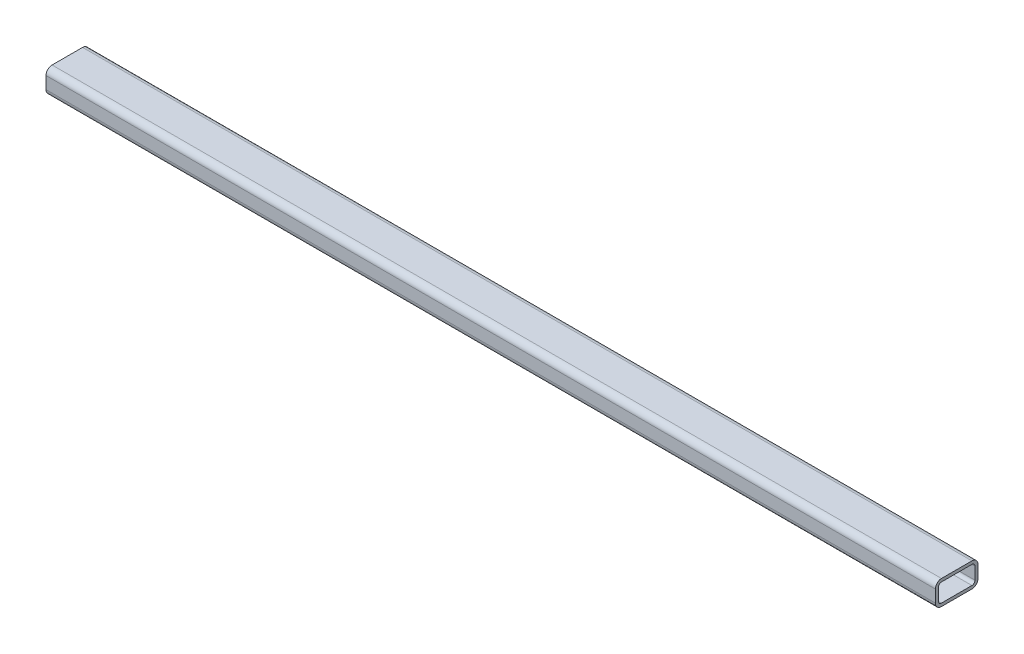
ISO-10303-21;
HEADER;
FILE_DESCRIPTION(('STEP AP214'),'2;1');
FILE_NAME('part.step','',(''),(''),'','','');
FILE_SCHEMA(('AUTOMOTIVE_DESIGN { 1 0 10303 214 1 1 1 1 }'));
ENDSEC;
DATA;
#1=APPLICATION_CONTEXT('core data for automotive mechanical design processes');
#2=APPLICATION_PROTOCOL_DEFINITION('international standard','automotive_design',2000,#1);
#3=PRODUCT_CONTEXT('',#1,'mechanical');
#4=PRODUCT('Part','Part','',(#3));
#5=PRODUCT_RELATED_PRODUCT_CATEGORY('part','',(#4));
#6=PRODUCT_DEFINITION_FORMATION('','',#4);
#7=PRODUCT_DEFINITION_CONTEXT('part definition',#1,'design');
#8=PRODUCT_DEFINITION('design','',#6,#7);
#9=PRODUCT_DEFINITION_SHAPE('','',#8);
#10=(LENGTH_UNIT() NAMED_UNIT(*) SI_UNIT(.MILLI.,.METRE.));
#11=(NAMED_UNIT(*) PLANE_ANGLE_UNIT() SI_UNIT($,.RADIAN.));
#12=(NAMED_UNIT(*) SI_UNIT($,.STERADIAN.) SOLID_ANGLE_UNIT());
#13=UNCERTAINTY_MEASURE_WITH_UNIT(LENGTH_MEASURE(1.E-05),#10,'distance_accuracy_value','');
#14=(GEOMETRIC_REPRESENTATION_CONTEXT(3) GLOBAL_UNCERTAINTY_ASSIGNED_CONTEXT((#13)) GLOBAL_UNIT_ASSIGNED_CONTEXT((#10,
#11,#12)) REPRESENTATION_CONTEXT('',''));
#15=CARTESIAN_POINT('',(0.,0.,0.));
#16=DIRECTION('',(0.,0.,1.));
#17=DIRECTION('',(1.,0.,0.));
#18=AXIS2_PLACEMENT_3D('',#15,#16,#17);
#19=CARTESIAN_POINT('',(730.,5.,-12.5));
#20=DIRECTION('',(1.,0.,0.));
#21=DIRECTION('',(0.,0.,-1.));
#22=AXIS2_PLACEMENT_3D('',#19,#20,#21);
#23=PLANE('',#22);
#24=CARTESIAN_POINT('',(730.,5.,-12.5));
#25=DIRECTION('',(1.,0.,0.));
#26=DIRECTION('',(0.,0.,-1.));
#27=AXIS2_PLACEMENT_3D('',#24,#25,#26);
#28=CIRCLE('',#27,5.);
#29=CARTESIAN_POINT('',(730.,5.,-17.5));
#30=VERTEX_POINT('',#29);
#31=CARTESIAN_POINT('',(730.,10.,-12.5));
#32=VERTEX_POINT('',#31);
#33=EDGE_CURVE('E228',#30,#32,#28,.T.);
#34=ORIENTED_EDGE('',*,*,#33,.T.);
#35=DIRECTION('',(0.,0.,1.));
#36=VECTOR('',#35,1.);
#37=CARTESIAN_POINT('',(730.,10.,12.5));
#38=LINE('',#37,#36);
#39=CARTESIAN_POINT('',(730.,10.,12.5));
#40=VERTEX_POINT('',#39);
#41=EDGE_CURVE('E231',#32,#40,#38,.T.);
#42=ORIENTED_EDGE('',*,*,#41,.T.);
#43=CARTESIAN_POINT('',(730.,5.,12.5));
#44=DIRECTION('',(1.,0.,0.));
#45=DIRECTION('',(0.,0.,1.));
#46=AXIS2_PLACEMENT_3D('',#43,#44,#45);
#47=CIRCLE('',#46,5.);
#48=CARTESIAN_POINT('',(730.,5.,17.5));
#49=VERTEX_POINT('',#48);
#50=EDGE_CURVE('E233',#40,#49,#47,.T.);
#51=ORIENTED_EDGE('',*,*,#50,.T.);
#52=DIRECTION('',(0.,-1.,0.));
#53=VECTOR('',#52,1.);
#54=CARTESIAN_POINT('',(730.,5.,17.5));
#55=LINE('',#54,#53);
#56=CARTESIAN_POINT('',(730.,-5.,17.5));
#57=VERTEX_POINT('',#56);
#58=EDGE_CURVE('E235',#49,#57,#55,.T.);
#59=ORIENTED_EDGE('',*,*,#58,.T.);
#60=CARTESIAN_POINT('',(730.,-5.,12.5));
#61=DIRECTION('',(1.,0.,0.));
#62=DIRECTION('',(0.,0.,1.));
#63=AXIS2_PLACEMENT_3D('',#60,#61,#62);
#64=CIRCLE('',#63,5.);
#65=CARTESIAN_POINT('',(730.,-10.,12.5));
#66=VERTEX_POINT('',#65);
#67=EDGE_CURVE('E237',#57,#66,#64,.T.);
#68=ORIENTED_EDGE('',*,*,#67,.T.);
#69=DIRECTION('',(0.,0.,-1.));
#70=VECTOR('',#69,1.);
#71=CARTESIAN_POINT('',(730.,-10.,12.5));
#72=LINE('',#71,#70);
#73=CARTESIAN_POINT('',(730.,-10.,-12.5));
#74=VERTEX_POINT('',#73);
#75=EDGE_CURVE('E239',#66,#74,#72,.T.);
#76=ORIENTED_EDGE('',*,*,#75,.T.);
#77=CARTESIAN_POINT('',(730.,-5.,-12.5));
#78=DIRECTION('',(1.,0.,0.));
#79=DIRECTION('',(0.,0.,1.));
#80=AXIS2_PLACEMENT_3D('',#77,#78,#79);
#81=CIRCLE('',#80,5.);
#82=CARTESIAN_POINT('',(730.,-5.,-17.5));
#83=VERTEX_POINT('',#82);
#84=EDGE_CURVE('E241',#74,#83,#81,.T.);
#85=ORIENTED_EDGE('',*,*,#84,.T.);
#86=DIRECTION('',(0.,1.,0.));
#87=VECTOR('',#86,1.);
#88=CARTESIAN_POINT('',(730.,5.,-17.5));
#89=LINE('',#88,#87);
#90=EDGE_CURVE('E243',#83,#30,#89,.T.);
#91=ORIENTED_EDGE('',*,*,#90,.T.);
#92=EDGE_LOOP('',(#34,#42,#51,#59,#68,#76,#85,#91));
#93=FACE_BOUND('',#92,.T.);
#94=DIRECTION('',(0.,-1.,0.));
#95=VECTOR('',#94,1.);
#96=CARTESIAN_POINT('',(730.,5.,15.));
#97=LINE('',#96,#95);
#98=CARTESIAN_POINT('',(730.,5.,15.));
#99=VERTEX_POINT('',#98);
#100=CARTESIAN_POINT('',(730.,-5.,15.));
#101=VERTEX_POINT('',#100);
#102=EDGE_CURVE('E186',#99,#101,#97,.T.);
#103=ORIENTED_EDGE('',*,*,#102,.F.);
#104=CARTESIAN_POINT('',(730.,5.,12.5));
#105=DIRECTION('',(1.,0.,0.));
#106=DIRECTION('',(0.,0.,1.));
#107=AXIS2_PLACEMENT_3D('',#104,#105,#106);
#108=CIRCLE('',#107,2.5);
#109=CARTESIAN_POINT('',(730.,7.5,12.5));
#110=VERTEX_POINT('',#109);
#111=EDGE_CURVE('E163',#110,#99,#108,.T.);
#112=ORIENTED_EDGE('',*,*,#111,.F.);
#113=DIRECTION('',(0.,0.,1.));
#114=VECTOR('',#113,1.);
#115=CARTESIAN_POINT('',(730.,7.5,12.5));
#116=LINE('',#115,#114);
#117=CARTESIAN_POINT('',(730.,7.5,-12.5));
#118=VERTEX_POINT('',#117);
#119=EDGE_CURVE('E198',#118,#110,#116,.T.);
#120=ORIENTED_EDGE('',*,*,#119,.F.);
#121=CARTESIAN_POINT('',(730.,5.,-12.5));
#122=DIRECTION('',(1.,0.,0.));
#123=DIRECTION('',(0.,0.,-1.));
#124=AXIS2_PLACEMENT_3D('',#121,#122,#123);
#125=CIRCLE('',#124,2.5);
#126=CARTESIAN_POINT('',(730.,5.,-15.));
#127=VERTEX_POINT('',#126);
#128=EDGE_CURVE('E196',#127,#118,#125,.T.);
#129=ORIENTED_EDGE('',*,*,#128,.F.);
#130=DIRECTION('',(0.,1.,0.));
#131=VECTOR('',#130,1.);
#132=CARTESIAN_POINT('',(730.,5.,-15.));
#133=LINE('',#132,#131);
#134=CARTESIAN_POINT('',(730.,-5.,-15.));
#135=VERTEX_POINT('',#134);
#136=EDGE_CURVE('E194',#135,#127,#133,.T.);
#137=ORIENTED_EDGE('',*,*,#136,.F.);
#138=CARTESIAN_POINT('',(730.,-5.,-12.5));
#139=DIRECTION('',(1.,0.,0.));
#140=DIRECTION('',(0.,0.,1.));
#141=AXIS2_PLACEMENT_3D('',#138,#139,#140);
#142=CIRCLE('',#141,2.5);
#143=CARTESIAN_POINT('',(730.,-7.5,-12.5));
#144=VERTEX_POINT('',#143);
#145=EDGE_CURVE('E192',#144,#135,#142,.T.);
#146=ORIENTED_EDGE('',*,*,#145,.F.);
#147=DIRECTION('',(0.,0.,-1.));
#148=VECTOR('',#147,1.);
#149=CARTESIAN_POINT('',(730.,-7.5,12.5));
#150=LINE('',#149,#148);
#151=CARTESIAN_POINT('',(730.,-7.5,12.5));
#152=VERTEX_POINT('',#151);
#153=EDGE_CURVE('E190',#152,#144,#150,.T.);
#154=ORIENTED_EDGE('',*,*,#153,.F.);
#155=CARTESIAN_POINT('',(730.,-5.,12.5));
#156=DIRECTION('',(1.,0.,0.));
#157=DIRECTION('',(0.,0.,1.));
#158=AXIS2_PLACEMENT_3D('',#155,#156,#157);
#159=CIRCLE('',#158,2.5);
#160=EDGE_CURVE('E188',#101,#152,#159,.T.);
#161=ORIENTED_EDGE('',*,*,#160,.F.);
#162=EDGE_LOOP('',(#103,#112,#120,#129,#137,#146,#154,#161));
#163=FACE_BOUND('',#162,.T.);
#164=ADVANCED_FACE('F35',(#93,#163),#23,.T.);
#165=CARTESIAN_POINT('',(0.,5.,-12.5));
#166=DIRECTION('',(1.,0.,0.));
#167=DIRECTION('',(0.,0.,-1.));
#168=AXIS2_PLACEMENT_3D('',#165,#166,#167);
#169=PLANE('',#168);
#170=CARTESIAN_POINT('',(0.,5.,-12.5));
#171=DIRECTION('',(1.,0.,0.));
#172=DIRECTION('',(0.,0.,-1.));
#173=AXIS2_PLACEMENT_3D('',#170,#171,#172);
#174=CIRCLE('',#173,5.);
#175=CARTESIAN_POINT('',(0.,5.,-17.5));
#176=VERTEX_POINT('',#175);
#177=CARTESIAN_POINT('',(0.,10.,-12.5));
#178=VERTEX_POINT('',#177);
#179=EDGE_CURVE('E164',#176,#178,#174,.T.);
#180=ORIENTED_EDGE('',*,*,#179,.F.);
#181=DIRECTION('',(0.,1.,0.));
#182=VECTOR('',#181,1.);
#183=CARTESIAN_POINT('',(0.,5.,-17.5));
#184=LINE('',#183,#182);
#185=CARTESIAN_POINT('',(0.,-5.,-17.5));
#186=VERTEX_POINT('',#185);
#187=EDGE_CURVE('E226',#186,#176,#184,.T.);
#188=ORIENTED_EDGE('',*,*,#187,.F.);
#189=CARTESIAN_POINT('',(0.,-5.,-12.5));
#190=DIRECTION('',(1.,0.,0.));
#191=DIRECTION('',(0.,0.,1.));
#192=AXIS2_PLACEMENT_3D('',#189,#190,#191);
#193=CIRCLE('',#192,5.);
#194=CARTESIAN_POINT('',(0.,-10.,-12.5));
#195=VERTEX_POINT('',#194);
#196=EDGE_CURVE('E224',#195,#186,#193,.T.);
#197=ORIENTED_EDGE('',*,*,#196,.F.);
#198=DIRECTION('',(0.,0.,-1.));
#199=VECTOR('',#198,1.);
#200=CARTESIAN_POINT('',(0.,-10.,12.5));
#201=LINE('',#200,#199);
#202=CARTESIAN_POINT('',(0.,-10.,12.5));
#203=VERTEX_POINT('',#202);
#204=EDGE_CURVE('E222',#203,#195,#201,.T.);
#205=ORIENTED_EDGE('',*,*,#204,.F.);
#206=CARTESIAN_POINT('',(0.,-5.,12.5));
#207=DIRECTION('',(1.,0.,0.));
#208=DIRECTION('',(0.,0.,1.));
#209=AXIS2_PLACEMENT_3D('',#206,#207,#208);
#210=CIRCLE('',#209,5.);
#211=CARTESIAN_POINT('',(0.,-5.,17.5));
#212=VERTEX_POINT('',#211);
#213=EDGE_CURVE('E220',#212,#203,#210,.T.);
#214=ORIENTED_EDGE('',*,*,#213,.F.);
#215=DIRECTION('',(0.,-1.,0.));
#216=VECTOR('',#215,1.);
#217=CARTESIAN_POINT('',(0.,5.,17.5));
#218=LINE('',#217,#216);
#219=CARTESIAN_POINT('',(0.,5.,17.5));
#220=VERTEX_POINT('',#219);
#221=EDGE_CURVE('E218',#220,#212,#218,.T.);
#222=ORIENTED_EDGE('',*,*,#221,.F.);
#223=CARTESIAN_POINT('',(0.,5.,12.5));
#224=DIRECTION('',(1.,0.,0.));
#225=DIRECTION('',(0.,0.,1.));
#226=AXIS2_PLACEMENT_3D('',#223,#224,#225);
#227=CIRCLE('',#226,5.);
#228=CARTESIAN_POINT('',(0.,10.,12.5));
#229=VERTEX_POINT('',#228);
#230=EDGE_CURVE('E216',#229,#220,#227,.T.);
#231=ORIENTED_EDGE('',*,*,#230,.F.);
#232=DIRECTION('',(0.,0.,1.));
#233=VECTOR('',#232,1.);
#234=CARTESIAN_POINT('',(0.,10.,12.5));
#235=LINE('',#234,#233);
#236=EDGE_CURVE('E214',#178,#229,#235,.T.);
#237=ORIENTED_EDGE('',*,*,#236,.F.);
#238=EDGE_LOOP('',(#180,#188,#197,#205,#214,#222,#231,#237));
#239=FACE_BOUND('',#238,.T.);
#240=CARTESIAN_POINT('',(0.,5.,12.5));
#241=DIRECTION('',(1.,0.,0.));
#242=DIRECTION('',(0.,0.,1.));
#243=AXIS2_PLACEMENT_3D('',#240,#241,#242);
#244=CIRCLE('',#243,2.5);
#245=CARTESIAN_POINT('',(0.,7.5,12.5));
#246=VERTEX_POINT('',#245);
#247=CARTESIAN_POINT('',(0.,5.,15.));
#248=VERTEX_POINT('',#247);
#249=EDGE_CURVE('E58',#246,#248,#244,.T.);
#250=ORIENTED_EDGE('',*,*,#249,.T.);
#251=DIRECTION('',(0.,-1.,0.));
#252=VECTOR('',#251,1.);
#253=CARTESIAN_POINT('',(0.,5.,15.));
#254=LINE('',#253,#252);
#255=CARTESIAN_POINT('',(0.,-5.,15.));
#256=VERTEX_POINT('',#255);
#257=EDGE_CURVE('E150',#248,#256,#254,.T.);
#258=ORIENTED_EDGE('',*,*,#257,.T.);
#259=CARTESIAN_POINT('',(0.,-5.,12.5));
#260=DIRECTION('',(1.,0.,0.));
#261=DIRECTION('',(0.,0.,1.));
#262=AXIS2_PLACEMENT_3D('',#259,#260,#261);
#263=CIRCLE('',#262,2.5);
#264=CARTESIAN_POINT('',(0.,-7.5,12.5));
#265=VERTEX_POINT('',#264);
#266=EDGE_CURVE('E159',#256,#265,#263,.T.);
#267=ORIENTED_EDGE('',*,*,#266,.T.);
#268=DIRECTION('',(0.,0.,-1.));
#269=VECTOR('',#268,1.);
#270=CARTESIAN_POINT('',(0.,-7.5,12.5));
#271=LINE('',#270,#269);
#272=CARTESIAN_POINT('',(0.,-7.5,-12.5));
#273=VERTEX_POINT('',#272);
#274=EDGE_CURVE('E173',#265,#273,#271,.T.);
#275=ORIENTED_EDGE('',*,*,#274,.T.);
#276=CARTESIAN_POINT('',(0.,-5.,-12.5));
#277=DIRECTION('',(1.,0.,0.));
#278=DIRECTION('',(0.,0.,1.));
#279=AXIS2_PLACEMENT_3D('',#276,#277,#278);
#280=CIRCLE('',#279,2.5);
#281=CARTESIAN_POINT('',(0.,-5.,-15.));
#282=VERTEX_POINT('',#281);
#283=EDGE_CURVE('E176',#273,#282,#280,.T.);
#284=ORIENTED_EDGE('',*,*,#283,.T.);
#285=DIRECTION('',(0.,1.,0.));
#286=VECTOR('',#285,1.);
#287=CARTESIAN_POINT('',(0.,5.,-15.));
#288=LINE('',#287,#286);
#289=CARTESIAN_POINT('',(0.,5.,-15.));
#290=VERTEX_POINT('',#289);
#291=EDGE_CURVE('E179',#282,#290,#288,.T.);
#292=ORIENTED_EDGE('',*,*,#291,.T.);
#293=CARTESIAN_POINT('',(0.,5.,-12.5));
#294=DIRECTION('',(1.,0.,0.));
#295=DIRECTION('',(0.,0.,-1.));
#296=AXIS2_PLACEMENT_3D('',#293,#294,#295);
#297=CIRCLE('',#296,2.5);
#298=CARTESIAN_POINT('',(0.,7.5,-12.5));
#299=VERTEX_POINT('',#298);
#300=EDGE_CURVE('E182',#290,#299,#297,.T.);
#301=ORIENTED_EDGE('',*,*,#300,.T.);
#302=DIRECTION('',(0.,0.,1.));
#303=VECTOR('',#302,1.);
#304=CARTESIAN_POINT('',(0.,7.5,12.5));
#305=LINE('',#304,#303);
#306=EDGE_CURVE('E169',#299,#246,#305,.T.);
#307=ORIENTED_EDGE('',*,*,#306,.T.);
#308=EDGE_LOOP('',(#250,#258,#267,#275,#284,#292,#301,#307));
#309=FACE_BOUND('',#308,.T.);
#310=ADVANCED_FACE('F167',(#239,#309),#169,.F.);
#311=CARTESIAN_POINT('',(730.,5.,-12.5));
#312=DIRECTION('',(-1.,0.,0.));
#313=DIRECTION('',(0.,0.,1.));
#314=AXIS2_PLACEMENT_3D('',#311,#312,#313);
#315=CYLINDRICAL_SURFACE('',#314,5.);
#316=ORIENTED_EDGE('',*,*,#179,.T.);
#317=DIRECTION('',(-1.,0.,0.));
#318=VECTOR('',#317,1.);
#319=CARTESIAN_POINT('',(730.,10.,-12.5));
#320=LINE('',#319,#318);
#321=EDGE_CURVE('E11',#32,#178,#320,.T.);
#322=ORIENTED_EDGE('',*,*,#321,.F.);
#323=ORIENTED_EDGE('',*,*,#33,.F.);
#324=DIRECTION('',(-1.,0.,0.));
#325=VECTOR('',#324,1.);
#326=CARTESIAN_POINT('',(730.,5.,-17.5));
#327=LINE('',#326,#325);
#328=EDGE_CURVE('E245',#30,#176,#327,.T.);
#329=ORIENTED_EDGE('',*,*,#328,.T.);
#330=EDGE_LOOP('',(#316,#322,#323,#329));
#331=FACE_BOUND('',#330,.T.);
#332=ADVANCED_FACE('F37',(#331),#315,.T.);
#333=CARTESIAN_POINT('',(730.,10.,12.5));
#334=DIRECTION('',(0.,-1.,0.));
#335=DIRECTION('',(0.,0.,-1.));
#336=AXIS2_PLACEMENT_3D('',#333,#334,#335);
#337=PLANE('',#336);
#338=ORIENTED_EDGE('',*,*,#236,.T.);
#339=DIRECTION('',(-1.,0.,0.));
#340=VECTOR('',#339,1.);
#341=CARTESIAN_POINT('',(730.,10.,12.5));
#342=LINE('',#341,#340);
#343=EDGE_CURVE('E43',#40,#229,#342,.T.);
#344=ORIENTED_EDGE('',*,*,#343,.F.);
#345=ORIENTED_EDGE('',*,*,#41,.F.);
#346=ORIENTED_EDGE('',*,*,#321,.T.);
#347=EDGE_LOOP('',(#338,#344,#345,#346));
#348=FACE_BOUND('',#347,.T.);
#349=ADVANCED_FACE('F290',(#348),#337,.F.);
#350=CARTESIAN_POINT('',(730.,5.,12.5));
#351=DIRECTION('',(-1.,0.,0.));
#352=DIRECTION('',(0.,0.,1.));
#353=AXIS2_PLACEMENT_3D('',#350,#351,#352);
#354=CYLINDRICAL_SURFACE('',#353,5.);
#355=ORIENTED_EDGE('',*,*,#230,.T.);
#356=DIRECTION('',(-1.,0.,0.));
#357=VECTOR('',#356,1.);
#358=CARTESIAN_POINT('',(730.,5.,17.5));
#359=LINE('',#358,#357);
#360=EDGE_CURVE('E261',#49,#220,#359,.T.);
#361=ORIENTED_EDGE('',*,*,#360,.F.);
#362=ORIENTED_EDGE('',*,*,#50,.F.);
#363=ORIENTED_EDGE('',*,*,#343,.T.);
#364=EDGE_LOOP('',(#355,#361,#362,#363));
#365=FACE_BOUND('',#364,.T.);
#366=ADVANCED_FACE('F268',(#365),#354,.T.);
#367=CARTESIAN_POINT('',(730.,5.,17.5));
#368=DIRECTION('',(0.,0.,-1.));
#369=DIRECTION('',(-1.,0.,0.));
#370=AXIS2_PLACEMENT_3D('',#367,#368,#369);
#371=PLANE('',#370);
#372=ORIENTED_EDGE('',*,*,#221,.T.);
#373=DIRECTION('',(-1.,0.,0.));
#374=VECTOR('',#373,1.);
#375=CARTESIAN_POINT('',(730.,-5.,17.5));
#376=LINE('',#375,#374);
#377=EDGE_CURVE('E258',#57,#212,#376,.T.);
#378=ORIENTED_EDGE('',*,*,#377,.F.);
#379=ORIENTED_EDGE('',*,*,#58,.F.);
#380=ORIENTED_EDGE('',*,*,#360,.T.);
#381=EDGE_LOOP('',(#372,#378,#379,#380));
#382=FACE_BOUND('',#381,.T.);
#383=ADVANCED_FACE('F278',(#382),#371,.F.);
#384=CARTESIAN_POINT('',(730.,-5.,12.5));
#385=DIRECTION('',(-1.,0.,0.));
#386=DIRECTION('',(0.,0.,1.));
#387=AXIS2_PLACEMENT_3D('',#384,#385,#386);
#388=CYLINDRICAL_SURFACE('',#387,5.);
#389=ORIENTED_EDGE('',*,*,#213,.T.);
#390=DIRECTION('',(-1.,0.,0.));
#391=VECTOR('',#390,1.);
#392=CARTESIAN_POINT('',(730.,-10.,12.5));
#393=LINE('',#392,#391);
#394=EDGE_CURVE('E255',#66,#203,#393,.T.);
#395=ORIENTED_EDGE('',*,*,#394,.F.);
#396=ORIENTED_EDGE('',*,*,#67,.F.);
#397=ORIENTED_EDGE('',*,*,#377,.T.);
#398=EDGE_LOOP('',(#389,#395,#396,#397));
#399=FACE_BOUND('',#398,.T.);
#400=ADVANCED_FACE('F282',(#399),#388,.T.);
#401=CARTESIAN_POINT('',(730.,-10.,12.5));
#402=DIRECTION('',(0.,1.,0.));
#403=DIRECTION('',(0.,0.,1.));
#404=AXIS2_PLACEMENT_3D('',#401,#402,#403);
#405=PLANE('',#404);
#406=ORIENTED_EDGE('',*,*,#204,.T.);
#407=DIRECTION('',(-1.,0.,0.));
#408=VECTOR('',#407,1.);
#409=CARTESIAN_POINT('',(730.,-10.,-12.5));
#410=LINE('',#409,#408);
#411=EDGE_CURVE('E252',#74,#195,#410,.T.);
#412=ORIENTED_EDGE('',*,*,#411,.F.);
#413=ORIENTED_EDGE('',*,*,#75,.F.);
#414=ORIENTED_EDGE('',*,*,#394,.T.);
#415=EDGE_LOOP('',(#406,#412,#413,#414));
#416=FACE_BOUND('',#415,.T.);
#417=ADVANCED_FACE('F303',(#416),#405,.F.);
#418=CARTESIAN_POINT('',(730.,-5.,-12.5));
#419=DIRECTION('',(-1.,0.,0.));
#420=DIRECTION('',(0.,0.,1.));
#421=AXIS2_PLACEMENT_3D('',#418,#419,#420);
#422=CYLINDRICAL_SURFACE('',#421,5.);
#423=ORIENTED_EDGE('',*,*,#196,.T.);
#424=DIRECTION('',(-1.,0.,0.));
#425=VECTOR('',#424,1.);
#426=CARTESIAN_POINT('',(730.,-5.,-17.5));
#427=LINE('',#426,#425);
#428=EDGE_CURVE('E248',#83,#186,#427,.T.);
#429=ORIENTED_EDGE('',*,*,#428,.F.);
#430=ORIENTED_EDGE('',*,*,#84,.F.);
#431=ORIENTED_EDGE('',*,*,#411,.T.);
#432=EDGE_LOOP('',(#423,#429,#430,#431));
#433=FACE_BOUND('',#432,.T.);
#434=ADVANCED_FACE('F301',(#433),#422,.T.);
#435=CARTESIAN_POINT('',(730.,5.,-17.5));
#436=DIRECTION('',(0.,0.,1.));
#437=DIRECTION('',(1.,0.,0.));
#438=AXIS2_PLACEMENT_3D('',#435,#436,#437);
#439=PLANE('',#438);
#440=ORIENTED_EDGE('',*,*,#187,.T.);
#441=ORIENTED_EDGE('',*,*,#328,.F.);
#442=ORIENTED_EDGE('',*,*,#90,.F.);
#443=ORIENTED_EDGE('',*,*,#428,.T.);
#444=EDGE_LOOP('',(#440,#441,#442,#443));
#445=FACE_BOUND('',#444,.T.);
#446=ADVANCED_FACE('F296',(#445),#439,.F.);
#447=CARTESIAN_POINT('',(730.,5.,12.5));
#448=DIRECTION('',(-1.,0.,0.));
#449=DIRECTION('',(0.,0.,1.));
#450=AXIS2_PLACEMENT_3D('',#447,#448,#449);
#451=CYLINDRICAL_SURFACE('',#450,2.5);
#452=ORIENTED_EDGE('',*,*,#249,.F.);
#453=DIRECTION('',(-1.,0.,0.));
#454=VECTOR('',#453,1.);
#455=CARTESIAN_POINT('',(730.,7.5,12.5));
#456=LINE('',#455,#454);
#457=EDGE_CURVE('E200',#110,#246,#456,.T.);
#458=ORIENTED_EDGE('',*,*,#457,.F.);
#459=ORIENTED_EDGE('',*,*,#111,.T.);
#460=DIRECTION('',(-1.,0.,0.));
#461=VECTOR('',#460,1.);
#462=CARTESIAN_POINT('',(730.,5.,15.));
#463=LINE('',#462,#461);
#464=EDGE_CURVE('E152',#99,#248,#463,.T.);
#465=ORIENTED_EDGE('',*,*,#464,.T.);
#466=EDGE_LOOP('',(#452,#458,#459,#465));
#467=FACE_BOUND('',#466,.T.);
#468=ADVANCED_FACE('F161',(#467),#451,.F.);
#469=CARTESIAN_POINT('',(730.,5.,15.));
#470=DIRECTION('',(0.,0.,-1.));
#471=DIRECTION('',(-1.,0.,0.));
#472=AXIS2_PLACEMENT_3D('',#469,#470,#471);
#473=PLANE('',#472);
#474=ORIENTED_EDGE('',*,*,#257,.F.);
#475=ORIENTED_EDGE('',*,*,#464,.F.);
#476=ORIENTED_EDGE('',*,*,#102,.T.);
#477=DIRECTION('',(-1.,0.,0.));
#478=VECTOR('',#477,1.);
#479=CARTESIAN_POINT('',(730.,-5.,15.));
#480=LINE('',#479,#478);
#481=EDGE_CURVE('E155',#101,#256,#480,.T.);
#482=ORIENTED_EDGE('',*,*,#481,.T.);
#483=EDGE_LOOP('',(#474,#475,#476,#482));
#484=FACE_BOUND('',#483,.T.);
#485=ADVANCED_FACE('F151',(#484),#473,.T.);
#486=CARTESIAN_POINT('',(730.,-5.,12.5));
#487=DIRECTION('',(-1.,0.,0.));
#488=DIRECTION('',(0.,0.,1.));
#489=AXIS2_PLACEMENT_3D('',#486,#487,#488);
#490=CYLINDRICAL_SURFACE('',#489,2.5);
#491=ORIENTED_EDGE('',*,*,#266,.F.);
#492=ORIENTED_EDGE('',*,*,#481,.F.);
#493=ORIENTED_EDGE('',*,*,#160,.T.);
#494=DIRECTION('',(-1.,0.,0.));
#495=VECTOR('',#494,1.);
#496=CARTESIAN_POINT('',(730.,-7.5,12.5));
#497=LINE('',#496,#495);
#498=EDGE_CURVE('E209',#152,#265,#497,.T.);
#499=ORIENTED_EDGE('',*,*,#498,.T.);
#500=EDGE_LOOP('',(#491,#492,#493,#499));
#501=FACE_BOUND('',#500,.T.);
#502=ADVANCED_FACE('F327',(#501),#490,.F.);
#503=CARTESIAN_POINT('',(730.,-7.5,12.5));
#504=DIRECTION('',(0.,1.,0.));
#505=DIRECTION('',(0.,0.,1.));
#506=AXIS2_PLACEMENT_3D('',#503,#504,#505);
#507=PLANE('',#506);
#508=ORIENTED_EDGE('',*,*,#274,.F.);
#509=ORIENTED_EDGE('',*,*,#498,.F.);
#510=ORIENTED_EDGE('',*,*,#153,.T.);
#511=DIRECTION('',(-1.,0.,0.));
#512=VECTOR('',#511,1.);
#513=CARTESIAN_POINT('',(730.,-7.5,-12.5));
#514=LINE('',#513,#512);
#515=EDGE_CURVE('E207',#144,#273,#514,.T.);
#516=ORIENTED_EDGE('',*,*,#515,.T.);
#517=EDGE_LOOP('',(#508,#509,#510,#516));
#518=FACE_BOUND('',#517,.T.);
#519=ADVANCED_FACE('F332',(#518),#507,.T.);
#520=CARTESIAN_POINT('',(730.,-5.,-12.5));
#521=DIRECTION('',(-1.,0.,0.));
#522=DIRECTION('',(0.,0.,1.));
#523=AXIS2_PLACEMENT_3D('',#520,#521,#522);
#524=CYLINDRICAL_SURFACE('',#523,2.5);
#525=ORIENTED_EDGE('',*,*,#283,.F.);
#526=ORIENTED_EDGE('',*,*,#515,.F.);
#527=ORIENTED_EDGE('',*,*,#145,.T.);
#528=DIRECTION('',(-1.,0.,0.));
#529=VECTOR('',#528,1.);
#530=CARTESIAN_POINT('',(730.,-5.,-15.));
#531=LINE('',#530,#529);
#532=EDGE_CURVE('E205',#135,#282,#531,.T.);
#533=ORIENTED_EDGE('',*,*,#532,.T.);
#534=EDGE_LOOP('',(#525,#526,#527,#533));
#535=FACE_BOUND('',#534,.T.);
#536=ADVANCED_FACE('F336',(#535),#524,.F.);
#537=CARTESIAN_POINT('',(730.,5.,-15.));
#538=DIRECTION('',(0.,0.,1.));
#539=DIRECTION('',(1.,0.,0.));
#540=AXIS2_PLACEMENT_3D('',#537,#538,#539);
#541=PLANE('',#540);
#542=ORIENTED_EDGE('',*,*,#291,.F.);
#543=ORIENTED_EDGE('',*,*,#532,.F.);
#544=ORIENTED_EDGE('',*,*,#136,.T.);
#545=DIRECTION('',(-1.,0.,0.));
#546=VECTOR('',#545,1.);
#547=CARTESIAN_POINT('',(730.,5.,-15.));
#548=LINE('',#547,#546);
#549=EDGE_CURVE('E203',#127,#290,#548,.T.);
#550=ORIENTED_EDGE('',*,*,#549,.T.);
#551=EDGE_LOOP('',(#542,#543,#544,#550));
#552=FACE_BOUND('',#551,.T.);
#553=ADVANCED_FACE('F340',(#552),#541,.T.);
#554=CARTESIAN_POINT('',(730.,5.,-12.5));
#555=DIRECTION('',(-1.,0.,0.));
#556=DIRECTION('',(0.,0.,1.));
#557=AXIS2_PLACEMENT_3D('',#554,#555,#556);
#558=CYLINDRICAL_SURFACE('',#557,2.5);
#559=ORIENTED_EDGE('',*,*,#300,.F.);
#560=ORIENTED_EDGE('',*,*,#549,.F.);
#561=ORIENTED_EDGE('',*,*,#128,.T.);
#562=DIRECTION('',(-1.,0.,0.));
#563=VECTOR('',#562,1.);
#564=CARTESIAN_POINT('',(730.,7.5,-12.5));
#565=LINE('',#564,#563);
#566=EDGE_CURVE('E50',#118,#299,#565,.T.);
#567=ORIENTED_EDGE('',*,*,#566,.T.);
#568=EDGE_LOOP('',(#559,#560,#561,#567));
#569=FACE_BOUND('',#568,.T.);
#570=ADVANCED_FACE('F344',(#569),#558,.F.);
#571=CARTESIAN_POINT('',(730.,7.5,12.5));
#572=DIRECTION('',(0.,-1.,0.));
#573=DIRECTION('',(0.,0.,-1.));
#574=AXIS2_PLACEMENT_3D('',#571,#572,#573);
#575=PLANE('',#574);
#576=ORIENTED_EDGE('',*,*,#306,.F.);
#577=ORIENTED_EDGE('',*,*,#566,.F.);
#578=ORIENTED_EDGE('',*,*,#119,.T.);
#579=ORIENTED_EDGE('',*,*,#457,.T.);
#580=EDGE_LOOP('',(#576,#577,#578,#579));
#581=FACE_BOUND('',#580,.T.);
#582=ADVANCED_FACE('F348',(#581),#575,.T.);
#583=CLOSED_SHELL('',(#164,#310,#332,#349,#366,#383,#400,#417,#434,#446,#468,#485,#502,#519,
#536,#553,#570,#582));
#584=MANIFOLD_SOLID_BREP('B2',#583);
#585=ADVANCED_BREP_SHAPE_REPRESENTATION('',(#18,#584),#14);
#586=SHAPE_DEFINITION_REPRESENTATION(#9,#585);
ENDSEC;
END-ISO-10303-21;
